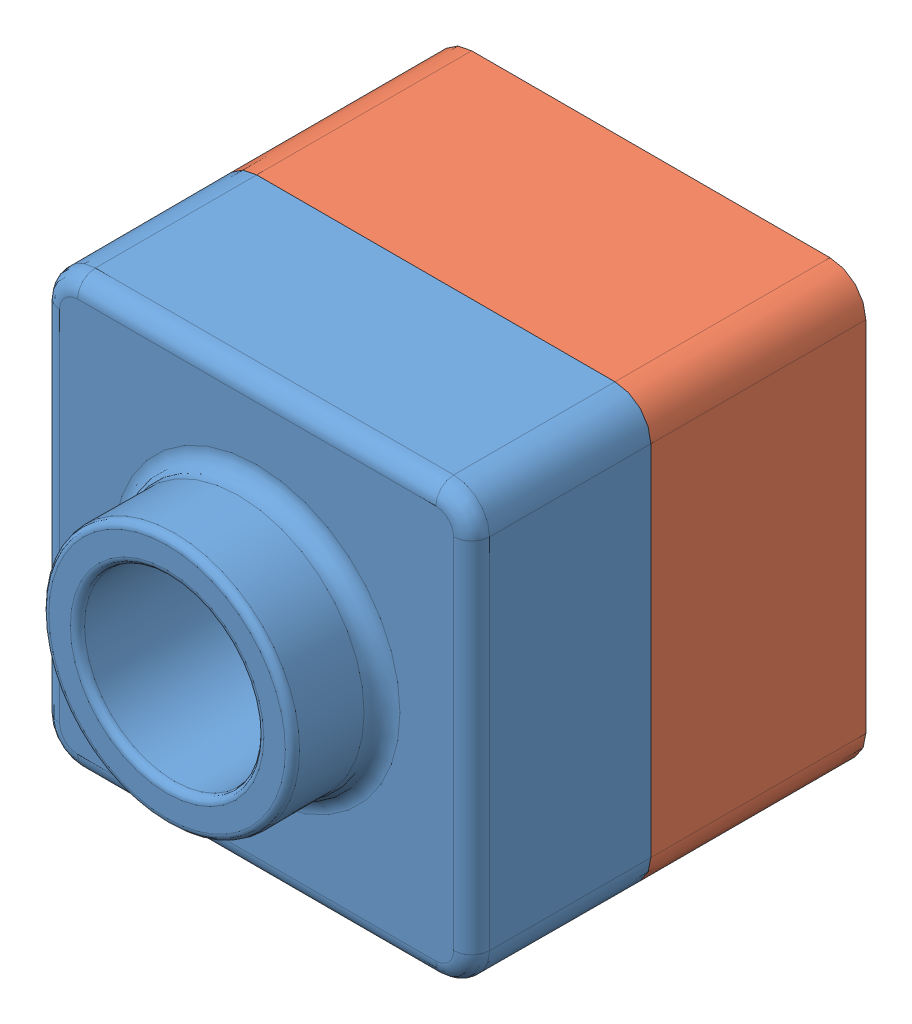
SolidWorks assembly Tutor.SLDASM, configuration Default (file format 8000). Lengths in mm.
Overall size (120 120 135).
2 component instances, 2 part files, 3 mates.
Components (placement in the parent):
- Tutor1-1: Tutor1.SLDPRT [Default] at origin size (120 120 75)
- Tutor2-1: Tutor2.SLDPRT [Default] at (0 0 -110) size (120 120 90)
Mates (geometry in assembly coordinates):
- Coincident1: coincident aligned: line of Tutor1-1 through (110 120 -50) axis (-1 0 0); line of Tutor2-1 through (110 120 -50) axis (-1 0 0)
- Coincident2: coincident aligned: plane of Tutor1-1 through (0 120 -50) normal (0 1 0); plane of Tutor2-1 through (0 120 -20) normal (0 1 0)
- Coincident3: coincident aligned: plane of Tutor1-1 through (120 0 -50) normal (1 0 0); plane of Tutor2-1 through (120 0 -20) normal (1 0 0)
